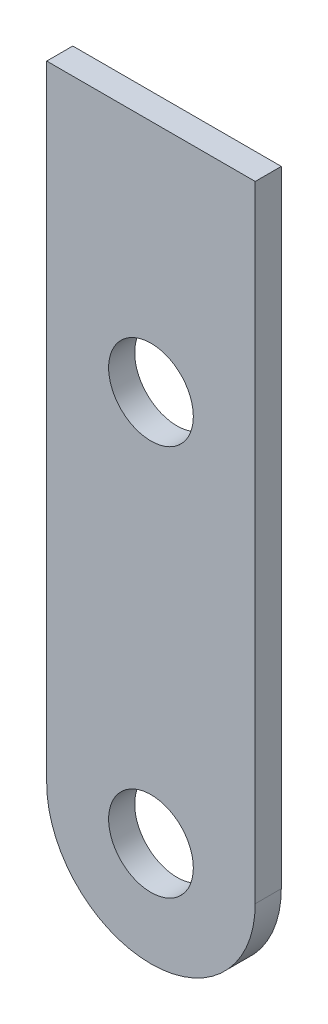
from build123d import *

# Parameters (mm, degrees)
SKETCH1_R           = 10.31875
BOSS_EXTRUDE1_DEPTH = 6.35


with BuildPart() as part:
    # Sketch1 → Boss-Extrude1 (new body)
    with BuildSketch(Plane.XY):
        with BuildLine():
            Line((0, 0), (0, -152.4))
            ThreePointArc((0, -152.4), (25.4, -177.8), (50.8, -152.4))
            Line((50.8, -152.4), (50.8, 0))
            Line((50.8, 0), (0, 0))
        make_face()
        with Locations((25.4, -152.4)):
            Circle(SKETCH1_R, mode=Mode.SUBTRACT)
        with Locations((25.4, -57.15)):
            Circle(SKETCH1_R, mode=Mode.SUBTRACT)
    extrude(amount=BOSS_EXTRUDE1_DEPTH)


solid = part.part
